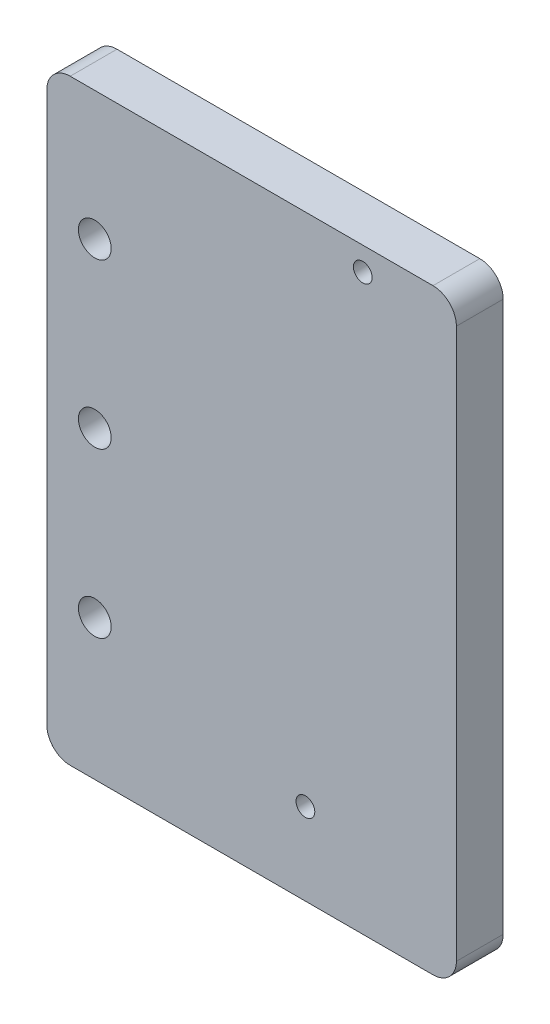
ISO-10303-21;
HEADER;
FILE_DESCRIPTION(('STEP AP214'),'2;1');
FILE_NAME('part.step','',(''),(''),'','','');
FILE_SCHEMA(('AUTOMOTIVE_DESIGN { 1 0 10303 214 1 1 1 1 }'));
ENDSEC;
DATA;
#1=APPLICATION_CONTEXT('core data for automotive mechanical design processes');
#2=APPLICATION_PROTOCOL_DEFINITION('international standard','automotive_design',2000,#1);
#3=PRODUCT_CONTEXT('',#1,'mechanical');
#4=PRODUCT('Part','Part','',(#3));
#5=PRODUCT_RELATED_PRODUCT_CATEGORY('part','',(#4));
#6=PRODUCT_DEFINITION_FORMATION('','',#4);
#7=PRODUCT_DEFINITION_CONTEXT('part definition',#1,'design');
#8=PRODUCT_DEFINITION('design','',#6,#7);
#9=PRODUCT_DEFINITION_SHAPE('','',#8);
#10=(LENGTH_UNIT() NAMED_UNIT(*) SI_UNIT(.MILLI.,.METRE.));
#11=(NAMED_UNIT(*) PLANE_ANGLE_UNIT() SI_UNIT($,.RADIAN.));
#12=(NAMED_UNIT(*) SI_UNIT($,.STERADIAN.) SOLID_ANGLE_UNIT());
#13=UNCERTAINTY_MEASURE_WITH_UNIT(LENGTH_MEASURE(1.E-05),#10,'distance_accuracy_value','');
#14=(GEOMETRIC_REPRESENTATION_CONTEXT(3) GLOBAL_UNCERTAINTY_ASSIGNED_CONTEXT((#13)) GLOBAL_UNIT_ASSIGNED_CONTEXT((#10,
#11,#12)) REPRESENTATION_CONTEXT('',''));
#15=CARTESIAN_POINT('',(0.,0.,0.));
#16=DIRECTION('',(0.,0.,1.));
#17=DIRECTION('',(1.,0.,0.));
#18=AXIS2_PLACEMENT_3D('',#15,#16,#17);
#19=CARTESIAN_POINT('',(10.,245.,20.));
#20=DIRECTION('',(0.,0.,-1.));
#21=DIRECTION('',(-1.,0.,0.));
#22=AXIS2_PLACEMENT_3D('',#19,#20,#21);
#23=CYLINDRICAL_SURFACE('',#22,10.);
#24=CARTESIAN_POINT('',(10.,245.,0.));
#25=DIRECTION('',(0.,0.,1.));
#26=DIRECTION('',(1.,0.,0.));
#27=AXIS2_PLACEMENT_3D('',#24,#25,#26);
#28=CIRCLE('',#27,10.);
#29=CARTESIAN_POINT('',(10.0000000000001,255.,0.));
#30=VERTEX_POINT('',#29);
#31=CARTESIAN_POINT('',(0.,245.,0.));
#32=VERTEX_POINT('',#31);
#33=EDGE_CURVE('E100',#30,#32,#28,.T.);
#34=ORIENTED_EDGE('',*,*,#33,.T.);
#35=DIRECTION('',(0.,0.,-1.));
#36=VECTOR('',#35,1.);
#37=CARTESIAN_POINT('',(0.,245.,20.));
#38=LINE('',#37,#36);
#39=CARTESIAN_POINT('',(0.,245.,20.));
#40=VERTEX_POINT('',#39);
#41=EDGE_CURVE('E11',#40,#32,#38,.T.);
#42=ORIENTED_EDGE('',*,*,#41,.F.);
#43=CARTESIAN_POINT('',(10.,245.,20.));
#44=DIRECTION('',(0.,0.,1.));
#45=DIRECTION('',(1.,0.,0.));
#46=AXIS2_PLACEMENT_3D('',#43,#44,#45);
#47=CIRCLE('',#46,10.);
#48=CARTESIAN_POINT('',(10.0000000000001,255.,20.));
#49=VERTEX_POINT('',#48);
#50=EDGE_CURVE('E132',#49,#40,#47,.T.);
#51=ORIENTED_EDGE('',*,*,#50,.F.);
#52=DIRECTION('',(0.,0.,-1.));
#53=VECTOR('',#52,1.);
#54=CARTESIAN_POINT('',(10.0000000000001,255.,20.));
#55=LINE('',#54,#53);
#56=EDGE_CURVE('E113',#49,#30,#55,.T.);
#57=ORIENTED_EDGE('',*,*,#56,.T.);
#58=EDGE_LOOP('',(#34,#42,#51,#57));
#59=FACE_BOUND('',#58,.T.);
#60=ADVANCED_FACE('F31',(#59),#23,.T.);
#61=CARTESIAN_POINT('',(0.,10.0000000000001,20.));
#62=DIRECTION('',(1.,0.,0.));
#63=DIRECTION('',(0.,0.,-1.));
#64=AXIS2_PLACEMENT_3D('',#61,#62,#63);
#65=PLANE('',#64);
#66=DIRECTION('',(0.,-1.,0.));
#67=VECTOR('',#66,1.);
#68=CARTESIAN_POINT('',(0.,10.0000000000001,0.));
#69=LINE('',#68,#67);
#70=CARTESIAN_POINT('',(0.,10.0000000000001,0.));
#71=VERTEX_POINT('',#70);
#72=EDGE_CURVE('E96',#32,#71,#69,.T.);
#73=ORIENTED_EDGE('',*,*,#72,.T.);
#74=DIRECTION('',(0.,0.,-1.));
#75=VECTOR('',#74,1.);
#76=CARTESIAN_POINT('',(0.,10.0000000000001,20.));
#77=LINE('',#76,#75);
#78=CARTESIAN_POINT('',(0.,10.0000000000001,20.));
#79=VERTEX_POINT('',#78);
#80=EDGE_CURVE('E39',#79,#71,#77,.T.);
#81=ORIENTED_EDGE('',*,*,#80,.F.);
#82=DIRECTION('',(0.,-1.,0.));
#83=VECTOR('',#82,1.);
#84=CARTESIAN_POINT('',(0.,10.0000000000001,20.));
#85=LINE('',#84,#83);
#86=EDGE_CURVE('E109',#40,#79,#85,.T.);
#87=ORIENTED_EDGE('',*,*,#86,.F.);
#88=ORIENTED_EDGE('',*,*,#41,.T.);
#89=EDGE_LOOP('',(#73,#81,#87,#88));
#90=FACE_BOUND('',#89,.T.);
#91=ADVANCED_FACE('F108',(#90),#65,.F.);
#92=CARTESIAN_POINT('',(10.,10.,20.));
#93=DIRECTION('',(0.,0.,-1.));
#94=DIRECTION('',(-1.,0.,0.));
#95=AXIS2_PLACEMENT_3D('',#92,#93,#94);
#96=CYLINDRICAL_SURFACE('',#95,10.);
#97=CARTESIAN_POINT('',(10.,10.,0.));
#98=DIRECTION('',(0.,0.,1.));
#99=DIRECTION('',(1.,0.,0.));
#100=AXIS2_PLACEMENT_3D('',#97,#98,#99);
#101=CIRCLE('',#100,10.);
#102=CARTESIAN_POINT('',(10.0000000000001,0.,0.));
#103=VERTEX_POINT('',#102);
#104=EDGE_CURVE('E102',#71,#103,#101,.T.);
#105=ORIENTED_EDGE('',*,*,#104,.T.);
#106=DIRECTION('',(0.,0.,-1.));
#107=VECTOR('',#106,1.);
#108=CARTESIAN_POINT('',(10.0000000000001,0.,20.));
#109=LINE('',#108,#107);
#110=CARTESIAN_POINT('',(10.0000000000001,0.,20.));
#111=VERTEX_POINT('',#110);
#112=EDGE_CURVE('E158',#111,#103,#109,.T.);
#113=ORIENTED_EDGE('',*,*,#112,.F.);
#114=CARTESIAN_POINT('',(10.,10.,20.));
#115=DIRECTION('',(0.,0.,1.));
#116=DIRECTION('',(1.,0.,0.));
#117=AXIS2_PLACEMENT_3D('',#114,#115,#116);
#118=CIRCLE('',#117,10.);
#119=EDGE_CURVE('E135',#79,#111,#118,.T.);
#120=ORIENTED_EDGE('',*,*,#119,.F.);
#121=ORIENTED_EDGE('',*,*,#80,.T.);
#122=EDGE_LOOP('',(#105,#113,#120,#121));
#123=FACE_BOUND('',#122,.T.);
#124=ADVANCED_FACE('F163',(#123),#96,.T.);
#125=CARTESIAN_POINT('',(10.0000000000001,0.,20.));
#126=DIRECTION('',(0.,1.,0.));
#127=DIRECTION('',(0.,0.,1.));
#128=AXIS2_PLACEMENT_3D('',#125,#126,#127);
#129=PLANE('',#128);
#130=DIRECTION('',(1.,0.,0.));
#131=VECTOR('',#130,1.);
#132=CARTESIAN_POINT('',(10.0000000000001,0.,0.));
#133=LINE('',#132,#131);
#134=CARTESIAN_POINT('',(165.,0.,0.));
#135=VERTEX_POINT('',#134);
#136=EDGE_CURVE('E122',#103,#135,#133,.T.);
#137=ORIENTED_EDGE('',*,*,#136,.T.);
#138=DIRECTION('',(0.,0.,-1.));
#139=VECTOR('',#138,1.);
#140=CARTESIAN_POINT('',(165.,0.,20.));
#141=LINE('',#140,#139);
#142=CARTESIAN_POINT('',(165.,0.,20.));
#143=VERTEX_POINT('',#142);
#144=EDGE_CURVE('E155',#143,#135,#141,.T.);
#145=ORIENTED_EDGE('',*,*,#144,.F.);
#146=DIRECTION('',(1.,0.,0.));
#147=VECTOR('',#146,1.);
#148=CARTESIAN_POINT('',(10.0000000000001,0.,20.));
#149=LINE('',#148,#147);
#150=EDGE_CURVE('E137',#111,#143,#149,.T.);
#151=ORIENTED_EDGE('',*,*,#150,.F.);
#152=ORIENTED_EDGE('',*,*,#112,.T.);
#153=EDGE_LOOP('',(#137,#145,#151,#152));
#154=FACE_BOUND('',#153,.T.);
#155=ADVANCED_FACE('F171',(#154),#129,.F.);
#156=CARTESIAN_POINT('',(165.,10.,20.));
#157=DIRECTION('',(0.,0.,-1.));
#158=DIRECTION('',(-1.,0.,0.));
#159=AXIS2_PLACEMENT_3D('',#156,#157,#158);
#160=CYLINDRICAL_SURFACE('',#159,10.);
#161=CARTESIAN_POINT('',(165.,10.,0.));
#162=DIRECTION('',(0.,0.,1.));
#163=DIRECTION('',(1.,0.,0.));
#164=AXIS2_PLACEMENT_3D('',#161,#162,#163);
#165=CIRCLE('',#164,10.);
#166=CARTESIAN_POINT('',(175.,10.0000000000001,0.));
#167=VERTEX_POINT('',#166);
#168=EDGE_CURVE('E124',#135,#167,#165,.T.);
#169=ORIENTED_EDGE('',*,*,#168,.T.);
#170=DIRECTION('',(0.,0.,-1.));
#171=VECTOR('',#170,1.);
#172=CARTESIAN_POINT('',(175.,10.0000000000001,20.));
#173=LINE('',#172,#171);
#174=CARTESIAN_POINT('',(175.,10.0000000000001,20.));
#175=VERTEX_POINT('',#174);
#176=EDGE_CURVE('E152',#175,#167,#173,.T.);
#177=ORIENTED_EDGE('',*,*,#176,.F.);
#178=CARTESIAN_POINT('',(165.,10.,20.));
#179=DIRECTION('',(0.,0.,1.));
#180=DIRECTION('',(1.,0.,0.));
#181=AXIS2_PLACEMENT_3D('',#178,#179,#180);
#182=CIRCLE('',#181,10.);
#183=EDGE_CURVE('E139',#143,#175,#182,.T.);
#184=ORIENTED_EDGE('',*,*,#183,.F.);
#185=ORIENTED_EDGE('',*,*,#144,.T.);
#186=EDGE_LOOP('',(#169,#177,#184,#185));
#187=FACE_BOUND('',#186,.T.);
#188=ADVANCED_FACE('F174',(#187),#160,.T.);
#189=CARTESIAN_POINT('',(175.,10.0000000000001,20.));
#190=DIRECTION('',(-1.,0.,0.));
#191=DIRECTION('',(0.,0.,1.));
#192=AXIS2_PLACEMENT_3D('',#189,#190,#191);
#193=PLANE('',#192);
#194=DIRECTION('',(0.,1.,0.));
#195=VECTOR('',#194,1.);
#196=CARTESIAN_POINT('',(175.,10.0000000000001,0.));
#197=LINE('',#196,#195);
#198=CARTESIAN_POINT('',(175.,245.,0.));
#199=VERTEX_POINT('',#198);
#200=EDGE_CURVE('E126',#167,#199,#197,.T.);
#201=ORIENTED_EDGE('',*,*,#200,.T.);
#202=DIRECTION('',(0.,0.,-1.));
#203=VECTOR('',#202,1.);
#204=CARTESIAN_POINT('',(175.,245.,20.));
#205=LINE('',#204,#203);
#206=CARTESIAN_POINT('',(175.,245.,20.));
#207=VERTEX_POINT('',#206);
#208=EDGE_CURVE('E149',#207,#199,#205,.T.);
#209=ORIENTED_EDGE('',*,*,#208,.F.);
#210=DIRECTION('',(0.,1.,0.));
#211=VECTOR('',#210,1.);
#212=CARTESIAN_POINT('',(175.,10.0000000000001,20.));
#213=LINE('',#212,#211);
#214=EDGE_CURVE('E141',#175,#207,#213,.T.);
#215=ORIENTED_EDGE('',*,*,#214,.F.);
#216=ORIENTED_EDGE('',*,*,#176,.T.);
#217=EDGE_LOOP('',(#201,#209,#215,#216));
#218=FACE_BOUND('',#217,.T.);
#219=ADVANCED_FACE('F179',(#218),#193,.F.);
#220=CARTESIAN_POINT('',(165.,245.,20.));
#221=DIRECTION('',(0.,0.,-1.));
#222=DIRECTION('',(-1.,0.,0.));
#223=AXIS2_PLACEMENT_3D('',#220,#221,#222);
#224=CYLINDRICAL_SURFACE('',#223,10.);
#225=CARTESIAN_POINT('',(165.,245.,0.));
#226=DIRECTION('',(0.,0.,1.));
#227=DIRECTION('',(1.,0.,0.));
#228=AXIS2_PLACEMENT_3D('',#225,#226,#227);
#229=CIRCLE('',#228,10.);
#230=CARTESIAN_POINT('',(165.,255.,0.));
#231=VERTEX_POINT('',#230);
#232=EDGE_CURVE('E128',#199,#231,#229,.T.);
#233=ORIENTED_EDGE('',*,*,#232,.T.);
#234=DIRECTION('',(0.,0.,-1.));
#235=VECTOR('',#234,1.);
#236=CARTESIAN_POINT('',(165.,255.,20.));
#237=LINE('',#236,#235);
#238=CARTESIAN_POINT('',(165.,255.,20.));
#239=VERTEX_POINT('',#238);
#240=EDGE_CURVE('E146',#239,#231,#237,.T.);
#241=ORIENTED_EDGE('',*,*,#240,.F.);
#242=CARTESIAN_POINT('',(165.,245.,20.));
#243=DIRECTION('',(0.,0.,1.));
#244=DIRECTION('',(1.,0.,0.));
#245=AXIS2_PLACEMENT_3D('',#242,#243,#244);
#246=CIRCLE('',#245,10.);
#247=EDGE_CURVE('E51',#207,#239,#246,.T.);
#248=ORIENTED_EDGE('',*,*,#247,.F.);
#249=ORIENTED_EDGE('',*,*,#208,.T.);
#250=EDGE_LOOP('',(#233,#241,#248,#249));
#251=FACE_BOUND('',#250,.T.);
#252=ADVANCED_FACE('F182',(#251),#224,.T.);
#253=CARTESIAN_POINT('',(10.0000000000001,255.,20.));
#254=DIRECTION('',(0.,-1.,0.));
#255=DIRECTION('',(0.,0.,-1.));
#256=AXIS2_PLACEMENT_3D('',#253,#254,#255);
#257=PLANE('',#256);
#258=DIRECTION('',(-1.,0.,0.));
#259=VECTOR('',#258,1.);
#260=CARTESIAN_POINT('',(10.0000000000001,255.,0.));
#261=LINE('',#260,#259);
#262=EDGE_CURVE('E130',#231,#30,#261,.T.);
#263=ORIENTED_EDGE('',*,*,#262,.T.);
#264=ORIENTED_EDGE('',*,*,#56,.F.);
#265=DIRECTION('',(-1.,0.,0.));
#266=VECTOR('',#265,1.);
#267=CARTESIAN_POINT('',(10.0000000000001,255.,20.));
#268=LINE('',#267,#266);
#269=EDGE_CURVE('E46',#239,#49,#268,.T.);
#270=ORIENTED_EDGE('',*,*,#269,.F.);
#271=ORIENTED_EDGE('',*,*,#240,.T.);
#272=EDGE_LOOP('',(#263,#264,#270,#271));
#273=FACE_BOUND('',#272,.T.);
#274=ADVANCED_FACE('F184',(#273),#257,.F.);
#275=CARTESIAN_POINT('',(10.,245.,20.));
#276=DIRECTION('',(0.,0.,1.));
#277=DIRECTION('',(1.,0.,0.));
#278=AXIS2_PLACEMENT_3D('',#275,#276,#277);
#279=PLANE('',#278);
#280=CARTESIAN_POINT('',(110.5,35.,20.));
#281=DIRECTION('',(0.,0.,1.));
#282=DIRECTION('',(1.,0.,0.));
#283=AXIS2_PLACEMENT_3D('',#280,#281,#282);
#284=CIRCLE('',#283,3.99999999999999);
#285=CARTESIAN_POINT('',(114.5,35.,20.));
#286=VERTEX_POINT('',#285);
#287=EDGE_CURVE('E292',#286,#286,#284,.T.);
#288=ORIENTED_EDGE('',*,*,#287,.F.);
#289=EDGE_LOOP('',(#288));
#290=FACE_BOUND('',#289,.T.);
#291=CARTESIAN_POINT('',(135.,245.,20.));
#292=DIRECTION('',(0.,0.,1.));
#293=DIRECTION('',(1.,0.,0.));
#294=AXIS2_PLACEMENT_3D('',#291,#292,#293);
#295=CIRCLE('',#294,3.99999999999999);
#296=CARTESIAN_POINT('',(139.,245.,20.));
#297=VERTEX_POINT('',#296);
#298=EDGE_CURVE('E34',#297,#297,#295,.T.);
#299=ORIENTED_EDGE('',*,*,#298,.F.);
#300=EDGE_LOOP('',(#299));
#301=FACE_BOUND('',#300,.T.);
#302=CARTESIAN_POINT('',(20.5,60.,20.));
#303=DIRECTION('',(0.,0.,1.));
#304=DIRECTION('',(1.,0.,0.));
#305=AXIS2_PLACEMENT_3D('',#302,#303,#304);
#306=CIRCLE('',#305,6.99999999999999);
#307=CARTESIAN_POINT('',(27.5,60.,20.));
#308=VERTEX_POINT('',#307);
#309=EDGE_CURVE('E305',#308,#308,#306,.T.);
#310=ORIENTED_EDGE('',*,*,#309,.F.);
#311=EDGE_LOOP('',(#310));
#312=FACE_BOUND('',#311,.T.);
#313=CARTESIAN_POINT('',(20.5,130.,20.));
#314=DIRECTION('',(0.,0.,1.));
#315=DIRECTION('',(1.,0.,0.));
#316=AXIS2_PLACEMENT_3D('',#313,#314,#315);
#317=CIRCLE('',#316,6.99999999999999);
#318=CARTESIAN_POINT('',(27.5,130.,20.));
#319=VERTEX_POINT('',#318);
#320=EDGE_CURVE('E311',#319,#319,#317,.T.);
#321=ORIENTED_EDGE('',*,*,#320,.F.);
#322=EDGE_LOOP('',(#321));
#323=FACE_BOUND('',#322,.T.);
#324=CARTESIAN_POINT('',(20.5,200.,20.));
#325=DIRECTION('',(0.,0.,1.));
#326=DIRECTION('',(1.,0.,0.));
#327=AXIS2_PLACEMENT_3D('',#324,#325,#326);
#328=CIRCLE('',#327,6.99999999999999);
#329=CARTESIAN_POINT('',(27.5,200.,20.));
#330=VERTEX_POINT('',#329);
#331=EDGE_CURVE('E114',#330,#330,#328,.T.);
#332=ORIENTED_EDGE('',*,*,#331,.F.);
#333=EDGE_LOOP('',(#332));
#334=FACE_BOUND('',#333,.T.);
#335=ORIENTED_EDGE('',*,*,#50,.T.);
#336=ORIENTED_EDGE('',*,*,#86,.T.);
#337=ORIENTED_EDGE('',*,*,#119,.T.);
#338=ORIENTED_EDGE('',*,*,#150,.T.);
#339=ORIENTED_EDGE('',*,*,#183,.T.);
#340=ORIENTED_EDGE('',*,*,#214,.T.);
#341=ORIENTED_EDGE('',*,*,#247,.T.);
#342=ORIENTED_EDGE('',*,*,#269,.T.);
#343=EDGE_LOOP('',(#335,#336,#337,#338,#339,#340,#341,#342));
#344=FACE_BOUND('',#343,.T.);
#345=ADVANCED_FACE('F166',(#290,#301,#312,#323,#334,#344),#279,.T.);
#346=CARTESIAN_POINT('',(10.,245.,0.));
#347=DIRECTION('',(0.,0.,1.));
#348=DIRECTION('',(1.,0.,0.));
#349=AXIS2_PLACEMENT_3D('',#346,#347,#348);
#350=PLANE('',#349);
#351=CARTESIAN_POINT('',(110.5,35.,0.));
#352=DIRECTION('',(0.,0.,-1.));
#353=DIRECTION('',(-1.,0.,0.));
#354=AXIS2_PLACEMENT_3D('',#351,#352,#353);
#355=CIRCLE('',#354,3.99999999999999);
#356=CARTESIAN_POINT('',(106.5,35.,0.));
#357=VERTEX_POINT('',#356);
#358=EDGE_CURVE('E295',#357,#357,#355,.T.);
#359=ORIENTED_EDGE('',*,*,#358,.F.);
#360=EDGE_LOOP('',(#359));
#361=FACE_BOUND('',#360,.T.);
#362=CARTESIAN_POINT('',(135.,245.,0.));
#363=DIRECTION('',(0.,0.,-1.));
#364=DIRECTION('',(-1.,0.,0.));
#365=AXIS2_PLACEMENT_3D('',#362,#363,#364);
#366=CIRCLE('',#365,3.99999999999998);
#367=CARTESIAN_POINT('',(131.,245.,0.));
#368=VERTEX_POINT('',#367);
#369=EDGE_CURVE('E297',#368,#368,#366,.T.);
#370=ORIENTED_EDGE('',*,*,#369,.F.);
#371=EDGE_LOOP('',(#370));
#372=FACE_BOUND('',#371,.T.);
#373=CARTESIAN_POINT('',(20.5,60.,0.));
#374=DIRECTION('',(0.,0.,-1.));
#375=DIRECTION('',(-1.,0.,0.));
#376=AXIS2_PLACEMENT_3D('',#373,#374,#375);
#377=CIRCLE('',#376,6.99999999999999);
#378=CARTESIAN_POINT('',(13.5,60.,0.));
#379=VERTEX_POINT('',#378);
#380=EDGE_CURVE('E302',#379,#379,#377,.T.);
#381=ORIENTED_EDGE('',*,*,#380,.F.);
#382=EDGE_LOOP('',(#381));
#383=FACE_BOUND('',#382,.T.);
#384=CARTESIAN_POINT('',(20.5,130.,0.));
#385=DIRECTION('',(0.,0.,-1.));
#386=DIRECTION('',(-1.,0.,0.));
#387=AXIS2_PLACEMENT_3D('',#384,#385,#386);
#388=CIRCLE('',#387,6.99999999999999);
#389=CARTESIAN_POINT('',(13.5,130.,0.));
#390=VERTEX_POINT('',#389);
#391=EDGE_CURVE('E308',#390,#390,#388,.T.);
#392=ORIENTED_EDGE('',*,*,#391,.F.);
#393=EDGE_LOOP('',(#392));
#394=FACE_BOUND('',#393,.T.);
#395=CARTESIAN_POINT('',(20.5,200.,0.));
#396=DIRECTION('',(0.,0.,-1.));
#397=DIRECTION('',(-1.,0.,0.));
#398=AXIS2_PLACEMENT_3D('',#395,#396,#397);
#399=CIRCLE('',#398,6.99999999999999);
#400=CARTESIAN_POINT('',(13.5,200.,0.));
#401=VERTEX_POINT('',#400);
#402=EDGE_CURVE('E117',#401,#401,#399,.T.);
#403=ORIENTED_EDGE('',*,*,#402,.F.);
#404=EDGE_LOOP('',(#403));
#405=FACE_BOUND('',#404,.T.);
#406=ORIENTED_EDGE('',*,*,#33,.F.);
#407=ORIENTED_EDGE('',*,*,#262,.F.);
#408=ORIENTED_EDGE('',*,*,#232,.F.);
#409=ORIENTED_EDGE('',*,*,#200,.F.);
#410=ORIENTED_EDGE('',*,*,#168,.F.);
#411=ORIENTED_EDGE('',*,*,#136,.F.);
#412=ORIENTED_EDGE('',*,*,#104,.F.);
#413=ORIENTED_EDGE('',*,*,#72,.F.);
#414=EDGE_LOOP('',(#406,#407,#408,#409,#410,#411,#412,#413));
#415=FACE_BOUND('',#414,.T.);
#416=ADVANCED_FACE('F97',(#361,#372,#383,#394,#405,#415),#350,.F.);
#417=CARTESIAN_POINT('',(20.5,200.,0.));
#418=DIRECTION('',(0.,0.,-1.));
#419=DIRECTION('',(-1.,0.,0.));
#420=AXIS2_PLACEMENT_3D('',#417,#418,#419);
#421=CYLINDRICAL_SURFACE('',#420,6.99999999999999);
#422=ORIENTED_EDGE('',*,*,#331,.T.);
#423=EDGE_LOOP('',(#422));
#424=FACE_BOUND('',#423,.T.);
#425=ORIENTED_EDGE('',*,*,#402,.T.);
#426=EDGE_LOOP('',(#425));
#427=FACE_BOUND('',#426,.T.);
#428=ADVANCED_FACE('F226',(#424,#427),#421,.F.);
#429=CARTESIAN_POINT('',(20.5,130.,0.));
#430=DIRECTION('',(0.,0.,-1.));
#431=DIRECTION('',(-1.,0.,0.));
#432=AXIS2_PLACEMENT_3D('',#429,#430,#431);
#433=CYLINDRICAL_SURFACE('',#432,6.99999999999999);
#434=ORIENTED_EDGE('',*,*,#320,.T.);
#435=EDGE_LOOP('',(#434));
#436=FACE_BOUND('',#435,.T.);
#437=ORIENTED_EDGE('',*,*,#391,.T.);
#438=EDGE_LOOP('',(#437));
#439=FACE_BOUND('',#438,.T.);
#440=ADVANCED_FACE('F231',(#436,#439),#433,.F.);
#441=CARTESIAN_POINT('',(20.5,60.,0.));
#442=DIRECTION('',(0.,0.,-1.));
#443=DIRECTION('',(-1.,0.,0.));
#444=AXIS2_PLACEMENT_3D('',#441,#442,#443);
#445=CYLINDRICAL_SURFACE('',#444,6.99999999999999);
#446=ORIENTED_EDGE('',*,*,#309,.T.);
#447=EDGE_LOOP('',(#446));
#448=FACE_BOUND('',#447,.T.);
#449=ORIENTED_EDGE('',*,*,#380,.T.);
#450=EDGE_LOOP('',(#449));
#451=FACE_BOUND('',#450,.T.);
#452=ADVANCED_FACE('F243',(#448,#451),#445,.F.);
#453=CARTESIAN_POINT('',(135.,245.,0.));
#454=DIRECTION('',(0.,0.,-1.));
#455=DIRECTION('',(-1.,0.,0.));
#456=AXIS2_PLACEMENT_3D('',#453,#454,#455);
#457=CYLINDRICAL_SURFACE('',#456,3.99999999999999);
#458=ORIENTED_EDGE('',*,*,#298,.T.);
#459=EDGE_LOOP('',(#458));
#460=FACE_BOUND('',#459,.T.);
#461=ORIENTED_EDGE('',*,*,#369,.T.);
#462=EDGE_LOOP('',(#461));
#463=FACE_BOUND('',#462,.T.);
#464=ADVANCED_FACE('F253',(#460,#463),#457,.F.);
#465=CARTESIAN_POINT('',(110.5,35.,0.));
#466=DIRECTION('',(0.,0.,-1.));
#467=DIRECTION('',(-1.,0.,0.));
#468=AXIS2_PLACEMENT_3D('',#465,#466,#467);
#469=CYLINDRICAL_SURFACE('',#468,3.99999999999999);
#470=ORIENTED_EDGE('',*,*,#287,.T.);
#471=EDGE_LOOP('',(#470));
#472=FACE_BOUND('',#471,.T.);
#473=ORIENTED_EDGE('',*,*,#358,.T.);
#474=EDGE_LOOP('',(#473));
#475=FACE_BOUND('',#474,.T.);
#476=ADVANCED_FACE('F275',(#472,#475),#469,.F.);
#477=CLOSED_SHELL('',(#60,#91,#124,#155,#188,#219,#252,#274,#345,#416,#428,#440,#452,#464,#476));
#478=MANIFOLD_SOLID_BREP('B2',#477);
#479=ADVANCED_BREP_SHAPE_REPRESENTATION('',(#18,#478),#14);
#480=SHAPE_DEFINITION_REPRESENTATION(#9,#479);
ENDSEC;
END-ISO-10303-21;
